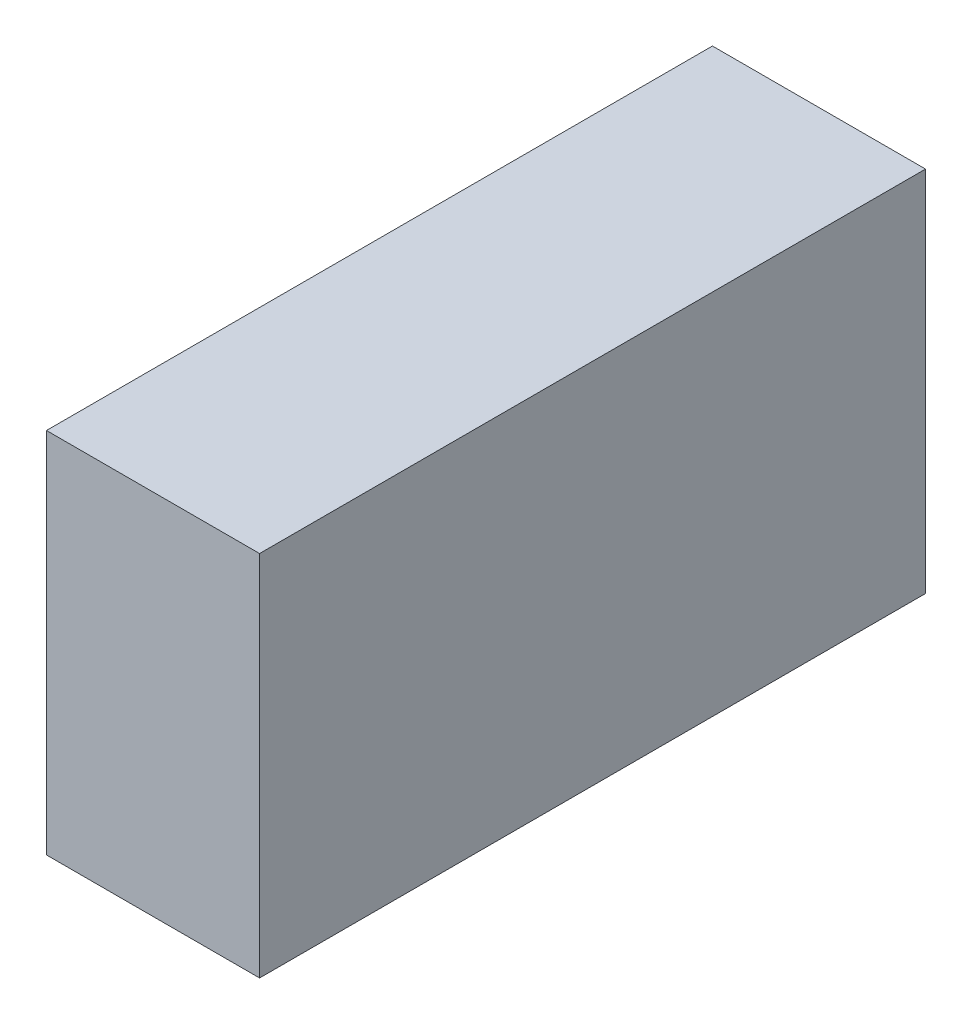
ISO-10303-21;
HEADER;
FILE_DESCRIPTION(('STEP AP214'),'2;1');
FILE_NAME('part.step','',(''),(''),'','','');
FILE_SCHEMA(('AUTOMOTIVE_DESIGN { 1 0 10303 214 1 1 1 1 }'));
ENDSEC;
DATA;
#1=APPLICATION_CONTEXT('core data for automotive mechanical design processes');
#2=APPLICATION_PROTOCOL_DEFINITION('international standard','automotive_design',2000,#1);
#3=PRODUCT_CONTEXT('',#1,'mechanical');
#4=PRODUCT('Part','Part','',(#3));
#5=PRODUCT_RELATED_PRODUCT_CATEGORY('part','',(#4));
#6=PRODUCT_DEFINITION_FORMATION('','',#4);
#7=PRODUCT_DEFINITION_CONTEXT('part definition',#1,'design');
#8=PRODUCT_DEFINITION('design','',#6,#7);
#9=PRODUCT_DEFINITION_SHAPE('','',#8);
#10=(LENGTH_UNIT() NAMED_UNIT(*) SI_UNIT(.MILLI.,.METRE.));
#11=(NAMED_UNIT(*) PLANE_ANGLE_UNIT() SI_UNIT($,.RADIAN.));
#12=(NAMED_UNIT(*) SI_UNIT($,.STERADIAN.) SOLID_ANGLE_UNIT());
#13=UNCERTAINTY_MEASURE_WITH_UNIT(LENGTH_MEASURE(1.E-05),#10,'distance_accuracy_value','');
#14=(GEOMETRIC_REPRESENTATION_CONTEXT(3) GLOBAL_UNCERTAINTY_ASSIGNED_CONTEXT((#13)) GLOBAL_UNIT_ASSIGNED_CONTEXT((#10,
#11,#12)) REPRESENTATION_CONTEXT('',''));
#15=CARTESIAN_POINT('',(0.,0.,0.));
#16=DIRECTION('',(0.,0.,1.));
#17=DIRECTION('',(1.,0.,0.));
#18=AXIS2_PLACEMENT_3D('',#15,#16,#17);
#19=CARTESIAN_POINT('',(0.,0.,25.));
#20=DIRECTION('',(1.,0.,0.));
#21=DIRECTION('',(0.,0.,-1.));
#22=AXIS2_PLACEMENT_3D('',#19,#20,#21);
#23=PLANE('',#22);
#24=DIRECTION('',(0.,-1.,0.));
#25=VECTOR('',#24,1.);
#26=CARTESIAN_POINT('',(0.,0.,0.));
#27=LINE('',#26,#25);
#28=CARTESIAN_POINT('',(0.,13.8,0.));
#29=VERTEX_POINT('',#28);
#30=CARTESIAN_POINT('',(0.,0.,0.));
#31=VERTEX_POINT('',#30);
#32=EDGE_CURVE('E72',#29,#31,#27,.T.);
#33=ORIENTED_EDGE('',*,*,#32,.T.);
#34=DIRECTION('',(0.,0.,-1.));
#35=VECTOR('',#34,1.);
#36=CARTESIAN_POINT('',(0.,0.,25.));
#37=LINE('',#36,#35);
#38=CARTESIAN_POINT('',(0.,0.,25.));
#39=VERTEX_POINT('',#38);
#40=EDGE_CURVE('E11',#39,#31,#37,.T.);
#41=ORIENTED_EDGE('',*,*,#40,.F.);
#42=DIRECTION('',(0.,-1.,0.));
#43=VECTOR('',#42,1.);
#44=CARTESIAN_POINT('',(0.,0.,25.));
#45=LINE('',#44,#43);
#46=CARTESIAN_POINT('',(0.,13.8,25.));
#47=VERTEX_POINT('',#46);
#48=EDGE_CURVE('E90',#47,#39,#45,.T.);
#49=ORIENTED_EDGE('',*,*,#48,.F.);
#50=DIRECTION('',(0.,0.,-1.));
#51=VECTOR('',#50,1.);
#52=CARTESIAN_POINT('',(0.,13.8,25.));
#53=LINE('',#52,#51);
#54=EDGE_CURVE('E84',#47,#29,#53,.T.);
#55=ORIENTED_EDGE('',*,*,#54,.T.);
#56=EDGE_LOOP('',(#33,#41,#49,#55));
#57=FACE_BOUND('',#56,.T.);
#58=ADVANCED_FACE('F28',(#57),#23,.F.);
#59=CARTESIAN_POINT('',(0.,0.,25.));
#60=DIRECTION('',(0.,1.,0.));
#61=DIRECTION('',(0.,0.,1.));
#62=AXIS2_PLACEMENT_3D('',#59,#60,#61);
#63=PLANE('',#62);
#64=DIRECTION('',(1.,0.,0.));
#65=VECTOR('',#64,1.);
#66=CARTESIAN_POINT('',(0.,0.,0.));
#67=LINE('',#66,#65);
#68=CARTESIAN_POINT('',(8.,0.,0.));
#69=VERTEX_POINT('',#68);
#70=EDGE_CURVE('E68',#31,#69,#67,.T.);
#71=ORIENTED_EDGE('',*,*,#70,.T.);
#72=DIRECTION('',(0.,0.,-1.));
#73=VECTOR('',#72,1.);
#74=CARTESIAN_POINT('',(8.,0.,25.));
#75=LINE('',#74,#73);
#76=CARTESIAN_POINT('',(8.,0.,25.));
#77=VERTEX_POINT('',#76);
#78=EDGE_CURVE('E35',#77,#69,#75,.T.);
#79=ORIENTED_EDGE('',*,*,#78,.F.);
#80=DIRECTION('',(1.,0.,0.));
#81=VECTOR('',#80,1.);
#82=CARTESIAN_POINT('',(0.,0.,25.));
#83=LINE('',#82,#81);
#84=EDGE_CURVE('E80',#39,#77,#83,.T.);
#85=ORIENTED_EDGE('',*,*,#84,.F.);
#86=ORIENTED_EDGE('',*,*,#40,.T.);
#87=EDGE_LOOP('',(#71,#79,#85,#86));
#88=FACE_BOUND('',#87,.T.);
#89=ADVANCED_FACE('F79',(#88),#63,.F.);
#90=CARTESIAN_POINT('',(8.,0.,25.));
#91=DIRECTION('',(-1.,0.,0.));
#92=DIRECTION('',(0.,-1.,0.));
#93=AXIS2_PLACEMENT_3D('',#90,#91,#92);
#94=PLANE('',#93);
#95=DIRECTION('',(0.,1.,0.));
#96=VECTOR('',#95,1.);
#97=CARTESIAN_POINT('',(8.,0.,0.));
#98=LINE('',#97,#96);
#99=CARTESIAN_POINT('',(8.,13.8,0.));
#100=VERTEX_POINT('',#99);
#101=EDGE_CURVE('E73',#69,#100,#98,.T.);
#102=ORIENTED_EDGE('',*,*,#101,.T.);
#103=DIRECTION('',(0.,0.,-1.));
#104=VECTOR('',#103,1.);
#105=CARTESIAN_POINT('',(8.,13.8,25.));
#106=LINE('',#105,#104);
#107=CARTESIAN_POINT('',(8.,13.8,25.));
#108=VERTEX_POINT('',#107);
#109=EDGE_CURVE('E96',#108,#100,#106,.T.);
#110=ORIENTED_EDGE('',*,*,#109,.F.);
#111=DIRECTION('',(0.,1.,0.));
#112=VECTOR('',#111,1.);
#113=CARTESIAN_POINT('',(8.,0.,25.));
#114=LINE('',#113,#112);
#115=EDGE_CURVE('E47',#77,#108,#114,.T.);
#116=ORIENTED_EDGE('',*,*,#115,.F.);
#117=ORIENTED_EDGE('',*,*,#78,.T.);
#118=EDGE_LOOP('',(#102,#110,#116,#117));
#119=FACE_BOUND('',#118,.T.);
#120=ADVANCED_FACE('F99',(#119),#94,.F.);
#121=CARTESIAN_POINT('',(0.,13.8,25.));
#122=DIRECTION('',(0.,-1.,0.));
#123=DIRECTION('',(0.,0.,-1.));
#124=AXIS2_PLACEMENT_3D('',#121,#122,#123);
#125=PLANE('',#124);
#126=DIRECTION('',(-1.,0.,0.));
#127=VECTOR('',#126,1.);
#128=CARTESIAN_POINT('',(0.,13.8,0.));
#129=LINE('',#128,#127);
#130=EDGE_CURVE('E88',#100,#29,#129,.T.);
#131=ORIENTED_EDGE('',*,*,#130,.T.);
#132=ORIENTED_EDGE('',*,*,#54,.F.);
#133=DIRECTION('',(-1.,0.,0.));
#134=VECTOR('',#133,1.);
#135=CARTESIAN_POINT('',(0.,13.8,25.));
#136=LINE('',#135,#134);
#137=EDGE_CURVE('E42',#108,#47,#136,.T.);
#138=ORIENTED_EDGE('',*,*,#137,.F.);
#139=ORIENTED_EDGE('',*,*,#109,.T.);
#140=EDGE_LOOP('',(#131,#132,#138,#139));
#141=FACE_BOUND('',#140,.T.);
#142=ADVANCED_FACE('F101',(#141),#125,.F.);
#143=CARTESIAN_POINT('',(0.,13.8,25.));
#144=DIRECTION('',(0.,0.,-1.));
#145=DIRECTION('',(-1.,0.,0.));
#146=AXIS2_PLACEMENT_3D('',#143,#144,#145);
#147=PLANE('',#146);
#148=ORIENTED_EDGE('',*,*,#48,.T.);
#149=ORIENTED_EDGE('',*,*,#84,.T.);
#150=ORIENTED_EDGE('',*,*,#115,.T.);
#151=ORIENTED_EDGE('',*,*,#137,.T.);
#152=EDGE_LOOP('',(#148,#149,#150,#151));
#153=FACE_BOUND('',#152,.T.);
#154=ADVANCED_FACE('F102',(#153),#147,.F.);
#155=CARTESIAN_POINT('',(0.,13.8,0.));
#156=DIRECTION('',(0.,0.,-1.));
#157=DIRECTION('',(-1.,0.,0.));
#158=AXIS2_PLACEMENT_3D('',#155,#156,#157);
#159=PLANE('',#158);
#160=ORIENTED_EDGE('',*,*,#32,.F.);
#161=ORIENTED_EDGE('',*,*,#130,.F.);
#162=ORIENTED_EDGE('',*,*,#101,.F.);
#163=ORIENTED_EDGE('',*,*,#70,.F.);
#164=EDGE_LOOP('',(#160,#161,#162,#163));
#165=FACE_BOUND('',#164,.T.);
#166=ADVANCED_FACE('F69',(#165),#159,.T.);
#167=CLOSED_SHELL('',(#58,#89,#120,#142,#154,#166));
#168=MANIFOLD_SOLID_BREP('B2',#167);
#169=ADVANCED_BREP_SHAPE_REPRESENTATION('',(#18,#168),#14);
#170=SHAPE_DEFINITION_REPRESENTATION(#9,#169);
ENDSEC;
END-ISO-10303-21;
